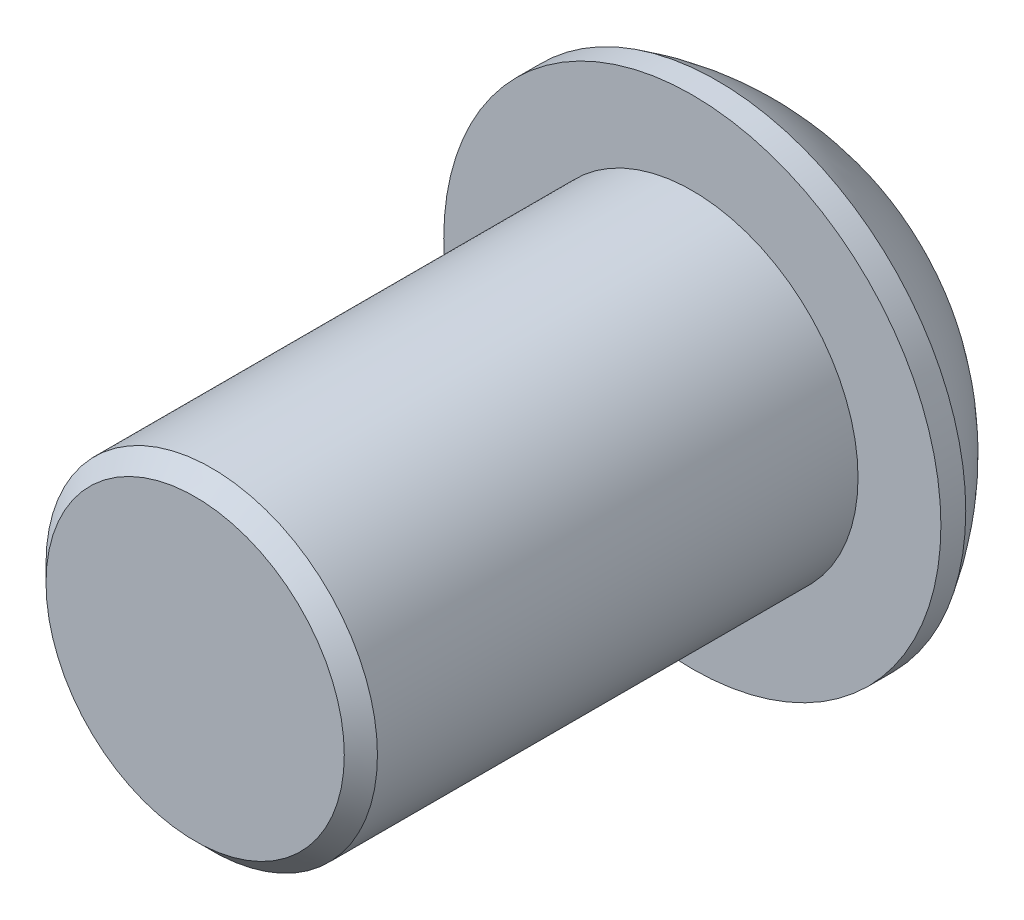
from build123d import *

# Parameters (mm, degrees)
SKETCH1_R      = 2
EXTRUDE1_DEPTH = 6
CHAMFER1_SIZE  = 0.2
EXTRUDE2_START = -1
SKETCH4_W      = 0.5
SKETCH4_H      = 6.281145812
EXTRUDE2_DEPTH = 7.34846931


with BuildPart() as part:
    # Sketch1 → Extrude1 (new body)
    with BuildSketch(Plane.XY):
        Circle(SKETCH1_R)
    extrude(amount=EXTRUDE1_DEPTH)

    # Chamfer1
    chamfer1_edges = [part.edges().sort_by_distance(p)[0] for p in [
        (-2, 0, 6),
    ]]
    chamfer(chamfer1_edges, length=CHAMFER1_SIZE)

    # Sketch3 → Revolve1 (revolve)
    with BuildSketch(Plane(origin=(0, 0, 0), x_dir=(1, 0, 0), z_dir=(0, 1, 0))):
        with BuildLine():
            Line((0, 0), (-3, 0))
            Line((-3, 0), (-3, 0.3))
            ThreePointArc((-3, 0.3), (-1.72387756, 1.545078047), (0, 2))
            Line((0, 2), (0, 0))
        make_face()
    revolve(axis=Axis((0, 0, 0), (0, 0, -1)))

    # Sketch4 → Extrude2 (cut, through all)
    with BuildSketch(Plane.XY.offset(EXTRUDE2_START)):
        Rectangle(SKETCH4_W, SKETCH4_H)
    extrude(amount=-EXTRUDE2_DEPTH, mode=Mode.SUBTRACT)


solid = part.part
